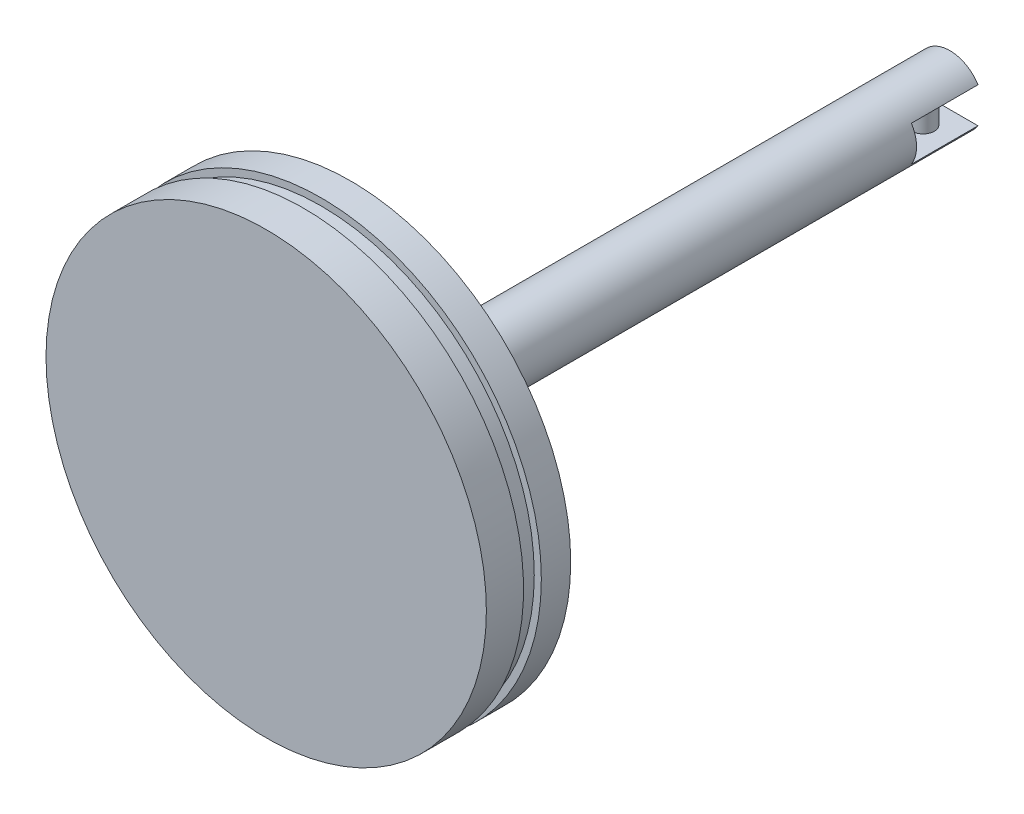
ISO-10303-21;
HEADER;
FILE_DESCRIPTION(('STEP AP214'),'2;1');
FILE_NAME('part.step','',(''),(''),'','','');
FILE_SCHEMA(('AUTOMOTIVE_DESIGN { 1 0 10303 214 1 1 1 1 }'));
ENDSEC;
DATA;
#1=APPLICATION_CONTEXT('core data for automotive mechanical design processes');
#2=APPLICATION_PROTOCOL_DEFINITION('international standard','automotive_design',2000,#1);
#3=PRODUCT_CONTEXT('',#1,'mechanical');
#4=PRODUCT('Part','Part','',(#3));
#5=PRODUCT_RELATED_PRODUCT_CATEGORY('part','',(#4));
#6=PRODUCT_DEFINITION_FORMATION('','',#4);
#7=PRODUCT_DEFINITION_CONTEXT('part definition',#1,'design');
#8=PRODUCT_DEFINITION('design','',#6,#7);
#9=PRODUCT_DEFINITION_SHAPE('','',#8);
#10=(LENGTH_UNIT() NAMED_UNIT(*) SI_UNIT(.MILLI.,.METRE.));
#11=(NAMED_UNIT(*) PLANE_ANGLE_UNIT() SI_UNIT($,.RADIAN.));
#12=(NAMED_UNIT(*) SI_UNIT($,.STERADIAN.) SOLID_ANGLE_UNIT());
#13=UNCERTAINTY_MEASURE_WITH_UNIT(LENGTH_MEASURE(1.E-05),#10,'distance_accuracy_value','');
#14=(GEOMETRIC_REPRESENTATION_CONTEXT(3) GLOBAL_UNCERTAINTY_ASSIGNED_CONTEXT((#13)) GLOBAL_UNIT_ASSIGNED_CONTEXT((#10,
#11,#12)) REPRESENTATION_CONTEXT('',''));
#15=CARTESIAN_POINT('',(0.,0.,0.));
#16=DIRECTION('',(0.,0.,1.));
#17=DIRECTION('',(1.,0.,0.));
#18=AXIS2_PLACEMENT_3D('',#15,#16,#17);
#19=CARTESIAN_POINT('',(0.,0.,-135.));
#20=DIRECTION('',(0.,0.,1.));
#21=DIRECTION('',(1.,0.,0.));
#22=AXIS2_PLACEMENT_3D('',#19,#20,#21);
#23=PLANE('',#22);
#24=CARTESIAN_POINT('',(0.,0.,-135.));
#25=DIRECTION('',(0.,0.,1.));
#26=DIRECTION('',(1.,0.,0.));
#27=AXIS2_PLACEMENT_3D('',#24,#25,#26);
#28=CIRCLE('',#27,7.5);
#29=CARTESIAN_POINT('',(-6.34428877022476,-4.,-135.));
#30=VERTEX_POINT('',#29);
#31=CARTESIAN_POINT('',(6.34428877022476,-4.,-135.));
#32=VERTEX_POINT('',#31);
#33=EDGE_CURVE('E107',#30,#32,#28,.T.);
#34=ORIENTED_EDGE('',*,*,#33,.F.);
#35=DIRECTION('',(1.,0.,0.));
#36=VECTOR('',#35,1.);
#37=CARTESIAN_POINT('',(0.,-4.,-135.));
#38=LINE('',#37,#36);
#39=EDGE_CURVE('E91',#30,#32,#38,.T.);
#40=ORIENTED_EDGE('',*,*,#39,.T.);
#41=EDGE_LOOP('',(#34,#40));
#42=FACE_BOUND('',#41,.T.);
#43=ADVANCED_FACE('F40',(#42),#23,.F.);
#44=CARTESIAN_POINT('',(0.,0.,3.));
#45=DIRECTION('',(0.,0.,-1.));
#46=DIRECTION('',(-1.,0.,0.));
#47=AXIS2_PLACEMENT_3D('',#44,#45,#46);
#48=CYLINDRICAL_SURFACE('',#47,49.6);
#49=CARTESIAN_POINT('',(0.,0.,0.));
#50=DIRECTION('',(0.,0.,1.));
#51=DIRECTION('',(1.,0.,0.));
#52=AXIS2_PLACEMENT_3D('',#49,#50,#51);
#53=CIRCLE('',#52,49.6);
#54=CARTESIAN_POINT('',(49.6,0.,0.));
#55=VERTEX_POINT('',#54);
#56=EDGE_CURVE('E155',#55,#55,#53,.T.);
#57=ORIENTED_EDGE('',*,*,#56,.T.);
#58=EDGE_LOOP('',(#57));
#59=FACE_BOUND('',#58,.T.);
#60=CARTESIAN_POINT('',(0.,0.,6.62025765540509));
#61=DIRECTION('',(0.,0.,1.));
#62=DIRECTION('',(1.,0.,0.));
#63=AXIS2_PLACEMENT_3D('',#60,#61,#62);
#64=CIRCLE('',#63,49.6);
#65=CARTESIAN_POINT('',(49.6,0.,6.62025765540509));
#66=VERTEX_POINT('',#65);
#67=EDGE_CURVE('E122',#66,#66,#64,.T.);
#68=ORIENTED_EDGE('',*,*,#67,.F.);
#69=EDGE_LOOP('',(#68));
#70=FACE_BOUND('',#69,.T.);
#71=ADVANCED_FACE('F42',(#59,#70),#48,.T.);
#72=CARTESIAN_POINT('',(0.,0.,0.));
#73=DIRECTION('',(0.,0.,1.));
#74=DIRECTION('',(1.,0.,0.));
#75=AXIS2_PLACEMENT_3D('',#72,#73,#74);
#76=PLANE('',#75);
#77=CARTESIAN_POINT('',(0.,0.,0.));
#78=DIRECTION('',(0.,0.,1.));
#79=DIRECTION('',(1.,0.,0.));
#80=AXIS2_PLACEMENT_3D('',#77,#78,#79);
#81=CIRCLE('',#80,7.5);
#82=CARTESIAN_POINT('',(7.5,0.,0.));
#83=VERTEX_POINT('',#82);
#84=EDGE_CURVE('E115',#83,#83,#81,.T.);
#85=ORIENTED_EDGE('',*,*,#84,.T.);
#86=EDGE_LOOP('',(#85));
#87=FACE_BOUND('',#86,.T.);
#88=ORIENTED_EDGE('',*,*,#56,.F.);
#89=EDGE_LOOP('',(#88));
#90=FACE_BOUND('',#89,.T.);
#91=ADVANCED_FACE('F251',(#87,#90),#76,.F.);
#92=CARTESIAN_POINT('',(0.,0.,-135.));
#93=DIRECTION('',(0.,0.,1.));
#94=DIRECTION('',(1.,0.,0.));
#95=AXIS2_PLACEMENT_3D('',#92,#93,#94);
#96=CYLINDRICAL_SURFACE('',#95,7.5);
#97=DIRECTION('',(0.,0.,1.));
#98=VECTOR('',#97,1.);
#99=CARTESIAN_POINT('',(-6.34428877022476,-4.,-135.));
#100=LINE('',#99,#98);
#101=CARTESIAN_POINT('',(-6.34428877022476,-4.,-120.));
#102=VERTEX_POINT('',#101);
#103=EDGE_CURVE('E65',#30,#102,#100,.T.);
#104=ORIENTED_EDGE('',*,*,#103,.F.);
#105=ORIENTED_EDGE('',*,*,#33,.T.);
#106=DIRECTION('',(0.,0.,1.));
#107=VECTOR('',#106,1.);
#108=CARTESIAN_POINT('',(6.34428877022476,-4.,-135.));
#109=LINE('',#108,#107);
#110=CARTESIAN_POINT('',(6.34428877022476,-4.,-120.));
#111=VERTEX_POINT('',#110);
#112=EDGE_CURVE('E211',#111,#32,#109,.F.);
#113=ORIENTED_EDGE('',*,*,#112,.F.);
#114=CARTESIAN_POINT('',(0.,0.,-120.));
#115=DIRECTION('',(0.,0.,1.));
#116=DIRECTION('',(1.,0.,0.));
#117=AXIS2_PLACEMENT_3D('',#114,#115,#116);
#118=CIRCLE('',#117,7.5);
#119=CARTESIAN_POINT('',(6.34428877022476,4.,-120.));
#120=VERTEX_POINT('',#119);
#121=EDGE_CURVE('E100',#120,#111,#118,.F.);
#122=ORIENTED_EDGE('',*,*,#121,.F.);
#123=DIRECTION('',(0.,0.,1.));
#124=VECTOR('',#123,1.);
#125=CARTESIAN_POINT('',(6.34428877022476,4.,-135.));
#126=LINE('',#125,#124);
#127=CARTESIAN_POINT('',(6.34428877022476,4.,-135.));
#128=VERTEX_POINT('',#127);
#129=EDGE_CURVE('E85',#128,#120,#126,.T.);
#130=ORIENTED_EDGE('',*,*,#129,.F.);
#131=CARTESIAN_POINT('',(-6.34428877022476,4.,-135.));
#132=VERTEX_POINT('',#131);
#133=EDGE_CURVE('E98',#128,#132,#28,.T.);
#134=ORIENTED_EDGE('',*,*,#133,.T.);
#135=DIRECTION('',(0.,0.,1.));
#136=VECTOR('',#135,1.);
#137=CARTESIAN_POINT('',(-6.34428877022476,4.,-135.));
#138=LINE('',#137,#136);
#139=CARTESIAN_POINT('',(-6.34428877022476,4.,-120.));
#140=VERTEX_POINT('',#139);
#141=EDGE_CURVE('E57',#140,#132,#138,.F.);
#142=ORIENTED_EDGE('',*,*,#141,.F.);
#143=EDGE_CURVE('E50',#102,#140,#118,.F.);
#144=ORIENTED_EDGE('',*,*,#143,.F.);
#145=EDGE_LOOP('',(#104,#105,#113,#122,#130,#134,#142,#144));
#146=FACE_BOUND('',#145,.T.);
#147=ORIENTED_EDGE('',*,*,#84,.F.);
#148=EDGE_LOOP('',(#147));
#149=FACE_BOUND('',#148,.T.);
#150=ADVANCED_FACE('F96',(#146,#149),#96,.T.);
#151=ORIENTED_EDGE('',*,*,#133,.F.);
#152=DIRECTION('',(-1.,0.,0.));
#153=VECTOR('',#152,1.);
#154=CARTESIAN_POINT('',(0.,4.,-135.));
#155=LINE('',#154,#153);
#156=EDGE_CURVE('E82',#128,#132,#155,.T.);
#157=ORIENTED_EDGE('',*,*,#156,.T.);
#158=EDGE_LOOP('',(#151,#157));
#159=FACE_BOUND('',#158,.T.);
#160=ADVANCED_FACE('F104',(#159),#23,.F.);
#161=CARTESIAN_POINT('',(0.,-50.8877083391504,6.62025765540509));
#162=DIRECTION('',(0.,0.,1.));
#163=DIRECTION('',(1.,0.,0.));
#164=AXIS2_PLACEMENT_3D('',#161,#162,#163);
#165=PLANE('',#164);
#166=CARTESIAN_POINT('',(0.,0.,6.62025765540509));
#167=DIRECTION('',(0.,0.,-1.));
#168=DIRECTION('',(-1.,0.,0.));
#169=AXIS2_PLACEMENT_3D('',#166,#167,#168);
#170=CIRCLE('',#169,48.0103822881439);
#171=CARTESIAN_POINT('',(-48.0103822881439,0.,6.62025765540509));
#172=VERTEX_POINT('',#171);
#173=EDGE_CURVE('E118',#172,#172,#170,.T.);
#174=ORIENTED_EDGE('',*,*,#173,.T.);
#175=EDGE_LOOP('',(#174));
#176=FACE_BOUND('',#175,.T.);
#177=ORIENTED_EDGE('',*,*,#67,.T.);
#178=EDGE_LOOP('',(#177));
#179=FACE_BOUND('',#178,.T.);
#180=ADVANCED_FACE('F225',(#176,#179),#165,.T.);
#181=CARTESIAN_POINT('',(0.,-50.8877083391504,10.6202576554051));
#182=DIRECTION('',(0.,0.,-1.));
#183=DIRECTION('',(-1.,0.,0.));
#184=AXIS2_PLACEMENT_3D('',#181,#182,#183);
#185=PLANE('',#184);
#186=CARTESIAN_POINT('',(0.,0.,10.6202576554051));
#187=DIRECTION('',(0.,0.,-1.));
#188=DIRECTION('',(-1.,0.,0.));
#189=AXIS2_PLACEMENT_3D('',#186,#187,#188);
#190=CIRCLE('',#189,48.0103822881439);
#191=CARTESIAN_POINT('',(-48.0103822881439,0.,10.6202576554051));
#192=VERTEX_POINT('',#191);
#193=EDGE_CURVE('E216',#192,#192,#190,.T.);
#194=ORIENTED_EDGE('',*,*,#193,.F.);
#195=EDGE_LOOP('',(#194));
#196=FACE_BOUND('',#195,.T.);
#197=CARTESIAN_POINT('',(0.,0.,10.6202576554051));
#198=DIRECTION('',(0.,0.,-1.));
#199=DIRECTION('',(-1.,0.,0.));
#200=AXIS2_PLACEMENT_3D('',#197,#198,#199);
#201=CIRCLE('',#200,49.6);
#202=CARTESIAN_POINT('',(-49.6,0.,10.6202576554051));
#203=VERTEX_POINT('',#202);
#204=EDGE_CURVE('E190',#203,#203,#201,.T.);
#205=ORIENTED_EDGE('',*,*,#204,.T.);
#206=EDGE_LOOP('',(#205));
#207=FACE_BOUND('',#206,.T.);
#208=ADVANCED_FACE('F231',(#196,#207),#185,.T.);
#209=CARTESIAN_POINT('',(0.,0.,0.));
#210=DIRECTION('',(0.,0.,-1.));
#211=DIRECTION('',(-1.,0.,0.));
#212=AXIS2_PLACEMENT_3D('',#209,#210,#211);
#213=CYLINDRICAL_SURFACE('',#212,48.0103822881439);
#214=ORIENTED_EDGE('',*,*,#193,.T.);
#215=EDGE_LOOP('',(#214));
#216=FACE_BOUND('',#215,.T.);
#217=ORIENTED_EDGE('',*,*,#173,.F.);
#218=EDGE_LOOP('',(#217));
#219=FACE_BOUND('',#218,.T.);
#220=ADVANCED_FACE('F228',(#216,#219),#213,.T.);
#221=CARTESIAN_POINT('',(0.,0.,19.));
#222=DIRECTION('',(0.,0.,1.));
#223=DIRECTION('',(1.,0.,0.));
#224=AXIS2_PLACEMENT_3D('',#221,#222,#223);
#225=PLANE('',#224);
#226=CARTESIAN_POINT('',(0.,0.,19.));
#227=DIRECTION('',(0.,0.,1.));
#228=DIRECTION('',(1.,0.,0.));
#229=AXIS2_PLACEMENT_3D('',#226,#227,#228);
#230=CIRCLE('',#229,49.6);
#231=CARTESIAN_POINT('',(49.6,0.,19.));
#232=VERTEX_POINT('',#231);
#233=EDGE_CURVE('E147',#232,#232,#230,.T.);
#234=ORIENTED_EDGE('',*,*,#233,.T.);
#235=EDGE_LOOP('',(#234));
#236=FACE_BOUND('',#235,.T.);
#237=ADVANCED_FACE('F230',(#236),#225,.T.);
#238=ORIENTED_EDGE('',*,*,#233,.F.);
#239=EDGE_LOOP('',(#238));
#240=FACE_BOUND('',#239,.T.);
#241=ORIENTED_EDGE('',*,*,#204,.F.);
#242=EDGE_LOOP('',(#241));
#243=FACE_BOUND('',#242,.T.);
#244=ADVANCED_FACE('F237',(#240,#243),#48,.T.);
#245=CARTESIAN_POINT('',(-10.6083117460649,-4.,-120.));
#246=DIRECTION('',(0.,-1.,0.));
#247=DIRECTION('',(1.,0.,0.));
#248=AXIS2_PLACEMENT_3D('',#245,#246,#247);
#249=PLANE('',#248);
#250=CARTESIAN_POINT('',(0.,-4.,-129.));
#251=DIRECTION('',(0.,-1.,0.));
#252=DIRECTION('',(1.,0.,0.));
#253=AXIS2_PLACEMENT_3D('',#250,#251,#252);
#254=CIRCLE('',#253,2.5);
#255=CARTESIAN_POINT('',(2.5,-4.,-129.));
#256=VERTEX_POINT('',#255);
#257=EDGE_CURVE('E11',#256,#256,#254,.F.);
#258=ORIENTED_EDGE('',*,*,#257,.F.);
#259=EDGE_LOOP('',(#258));
#260=FACE_BOUND('',#259,.T.);
#261=ORIENTED_EDGE('',*,*,#112,.T.);
#262=ORIENTED_EDGE('',*,*,#39,.F.);
#263=ORIENTED_EDGE('',*,*,#103,.T.);
#264=DIRECTION('',(-1.,0.,0.));
#265=VECTOR('',#264,1.);
#266=CARTESIAN_POINT('',(-10.6083117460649,-4.,-120.));
#267=LINE('',#266,#265);
#268=EDGE_CURVE('E102',#111,#102,#267,.T.);
#269=ORIENTED_EDGE('',*,*,#268,.F.);
#270=EDGE_LOOP('',(#261,#262,#263,#269));
#271=FACE_BOUND('',#270,.T.);
#272=ADVANCED_FACE('F394',(#260,#271),#249,.F.);
#273=CARTESIAN_POINT('',(-10.6083117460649,4.,-120.));
#274=DIRECTION('',(0.,1.,0.));
#275=DIRECTION('',(-1.,0.,0.));
#276=AXIS2_PLACEMENT_3D('',#273,#274,#275);
#277=PLANE('',#276);
#278=ORIENTED_EDGE('',*,*,#141,.T.);
#279=ORIENTED_EDGE('',*,*,#156,.F.);
#280=ORIENTED_EDGE('',*,*,#129,.T.);
#281=DIRECTION('',(1.,0.,0.));
#282=VECTOR('',#281,1.);
#283=CARTESIAN_POINT('',(-10.6083117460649,4.,-120.));
#284=LINE('',#283,#282);
#285=EDGE_CURVE('E204',#140,#120,#284,.T.);
#286=ORIENTED_EDGE('',*,*,#285,.F.);
#287=EDGE_LOOP('',(#278,#279,#280,#286));
#288=FACE_BOUND('',#287,.T.);
#289=ADVANCED_FACE('F84',(#288),#277,.F.);
#290=CARTESIAN_POINT('',(0.,0.,-120.));
#291=DIRECTION('',(0.,0.,1.));
#292=DIRECTION('',(1.,0.,0.));
#293=AXIS2_PLACEMENT_3D('',#290,#291,#292);
#294=PLANE('',#293);
#295=ORIENTED_EDGE('',*,*,#143,.T.);
#296=ORIENTED_EDGE('',*,*,#285,.T.);
#297=ORIENTED_EDGE('',*,*,#121,.T.);
#298=ORIENTED_EDGE('',*,*,#268,.T.);
#299=EDGE_LOOP('',(#295,#296,#297,#298));
#300=FACE_BOUND('',#299,.T.);
#301=ADVANCED_FACE('F203',(#300),#294,.F.);
#302=CARTESIAN_POINT('',(0.,3.,-129.));
#303=DIRECTION('',(0.,-1.,0.));
#304=DIRECTION('',(1.,0.,0.));
#305=AXIS2_PLACEMENT_3D('',#302,#303,#304);
#306=CYLINDRICAL_SURFACE('',#305,2.5);
#307=CARTESIAN_POINT('',(0.,3.,-129.));
#308=DIRECTION('',(0.,1.,0.));
#309=DIRECTION('',(-1.,0.,0.));
#310=AXIS2_PLACEMENT_3D('',#307,#308,#309);
#311=CIRCLE('',#310,2.5);
#312=CARTESIAN_POINT('',(-2.5,3.,-129.));
#313=VERTEX_POINT('',#312);
#314=EDGE_CURVE('E206',#313,#313,#311,.T.);
#315=ORIENTED_EDGE('',*,*,#314,.F.);
#316=EDGE_LOOP('',(#315));
#317=FACE_BOUND('',#316,.T.);
#318=ORIENTED_EDGE('',*,*,#257,.T.);
#319=EDGE_LOOP('',(#318));
#320=FACE_BOUND('',#319,.T.);
#321=ADVANCED_FACE('F410',(#317,#320),#306,.T.);
#322=CARTESIAN_POINT('',(0.,3.,-129.));
#323=DIRECTION('',(0.,1.,0.));
#324=DIRECTION('',(-1.,0.,0.));
#325=AXIS2_PLACEMENT_3D('',#322,#323,#324);
#326=PLANE('',#325);
#327=ORIENTED_EDGE('',*,*,#314,.T.);
#328=EDGE_LOOP('',(#327));
#329=FACE_BOUND('',#328,.T.);
#330=ADVANCED_FACE('F416',(#329),#326,.T.);
#331=CLOSED_SHELL('',(#43,#71,#91,#150,#160,#180,#208,#220,#237,#244,#272,#289,#301,#321,#330));
#332=CARTESIAN_POINT('',(0.,0.,3.));
#333=DIRECTION('',(0.,0.,1.));
#334=DIRECTION('',(1.,0.,0.));
#335=AXIS2_PLACEMENT_3D('',#332,#333,#334);
#336=PLANE('',#335);
#337=CARTESIAN_POINT('',(0.,0.,3.));
#338=DIRECTION('',(0.,0.,1.));
#339=DIRECTION('',(1.,0.,0.));
#340=AXIS2_PLACEMENT_3D('',#337,#338,#339);
#341=CIRCLE('',#340,5.);
#342=CARTESIAN_POINT('',(5.,0.,3.));
#343=VERTEX_POINT('',#342);
#344=EDGE_CURVE('E106',#343,#343,#341,.T.);
#345=ORIENTED_EDGE('',*,*,#344,.F.);
#346=EDGE_LOOP('',(#345));
#347=FACE_BOUND('',#346,.T.);
#348=CARTESIAN_POINT('',(-12.5553753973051,26.3329781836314,3.));
#349=DIRECTION('',(0.,0.,1.));
#350=DIRECTION('',(1.,0.,0.));
#351=AXIS2_PLACEMENT_3D('',#348,#349,#350);
#352=CIRCLE('',#351,2.5);
#353=CARTESIAN_POINT('',(-10.0553753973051,26.3329781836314,3.));
#354=VERTEX_POINT('',#353);
#355=EDGE_CURVE('E112',#354,#354,#352,.T.);
#356=ORIENTED_EDGE('',*,*,#355,.F.);
#357=EDGE_LOOP('',(#356));
#358=FACE_BOUND('',#357,.T.);
#359=CARTESIAN_POINT('',(17.4025494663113,21.919229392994,3.));
#360=DIRECTION('',(0.,0.,1.));
#361=DIRECTION('',(1.,0.,0.));
#362=AXIS2_PLACEMENT_3D('',#359,#360,#361);
#363=CIRCLE('',#362,2.5);
#364=CARTESIAN_POINT('',(19.9025494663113,21.919229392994,3.));
#365=VERTEX_POINT('',#364);
#366=EDGE_CURVE('E127',#365,#365,#363,.T.);
#367=ORIENTED_EDGE('',*,*,#366,.F.);
#368=EDGE_LOOP('',(#367));
#369=FACE_BOUND('',#368,.T.);
#370=CARTESIAN_POINT('',(29.0283101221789,-5.22974658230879,3.));
#371=DIRECTION('',(0.,0.,1.));
#372=DIRECTION('',(1.,0.,0.));
#373=AXIS2_PLACEMENT_3D('',#370,#371,#372);
#374=CIRCLE('',#373,2.5);
#375=CARTESIAN_POINT('',(31.5283101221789,-5.22974658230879,3.));
#376=VERTEX_POINT('',#375);
#377=EDGE_CURVE('E131',#376,#376,#374,.T.);
#378=ORIENTED_EDGE('',*,*,#377,.F.);
#379=EDGE_LOOP('',(#378));
#380=FACE_BOUND('',#379,.T.);
#381=CARTESIAN_POINT('',(10.7973914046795,-30.7469047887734,3.));
#382=DIRECTION('',(0.,0.,1.));
#383=DIRECTION('',(1.,0.,0.));
#384=AXIS2_PLACEMENT_3D('',#381,#382,#383);
#385=CIRCLE('',#384,2.5);
#386=CARTESIAN_POINT('',(13.2973914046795,-30.7469047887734,3.));
#387=VERTEX_POINT('',#386);
#388=EDGE_CURVE('E135',#387,#387,#385,.T.);
#389=ORIENTED_EDGE('',*,*,#388,.F.);
#390=EDGE_LOOP('',(#389));
#391=FACE_BOUND('',#390,.T.);
#392=CARTESIAN_POINT('',(-20.9711520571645,-26.3717704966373,3.));
#393=DIRECTION('',(0.,0.,1.));
#394=DIRECTION('',(1.,0.,0.));
#395=AXIS2_PLACEMENT_3D('',#392,#393,#394);
#396=CIRCLE('',#395,2.5);
#397=CARTESIAN_POINT('',(-18.4711520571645,-26.3717704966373,3.));
#398=VERTEX_POINT('',#397);
#399=EDGE_CURVE('E139',#398,#398,#396,.T.);
#400=ORIENTED_EDGE('',*,*,#399,.F.);
#401=EDGE_LOOP('',(#400));
#402=FACE_BOUND('',#401,.T.);
#403=CARTESIAN_POINT('',(-35.9876396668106,-3.67966705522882,3.));
#404=DIRECTION('',(0.,0.,1.));
#405=DIRECTION('',(1.,0.,0.));
#406=AXIS2_PLACEMENT_3D('',#403,#404,#405);
#407=CIRCLE('',#406,2.5);
#408=CARTESIAN_POINT('',(-33.4876396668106,-3.67966705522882,3.));
#409=VERTEX_POINT('',#408);
#410=EDGE_CURVE('E143',#409,#409,#407,.T.);
#411=ORIENTED_EDGE('',*,*,#410,.F.);
#412=EDGE_LOOP('',(#411));
#413=FACE_BOUND('',#412,.T.);
#414=CARTESIAN_POINT('',(0.,0.,3.));
#415=DIRECTION('',(0.,0.,1.));
#416=DIRECTION('',(1.,0.,0.));
#417=AXIS2_PLACEMENT_3D('',#414,#415,#416);
#418=CIRCLE('',#417,46.);
#419=CARTESIAN_POINT('',(46.,0.,3.));
#420=VERTEX_POINT('',#419);
#421=EDGE_CURVE('E156',#420,#420,#418,.F.);
#422=ORIENTED_EDGE('',*,*,#421,.F.);
#423=EDGE_LOOP('',(#422));
#424=FACE_BOUND('',#423,.T.);
#425=ADVANCED_FACE('F301',(#347,#358,#369,#380,#391,#402,#413,#424),#336,.T.);
#426=CARTESIAN_POINT('',(0.,0.,15.));
#427=DIRECTION('',(0.,0.,-1.));
#428=DIRECTION('',(-1.,0.,0.));
#429=AXIS2_PLACEMENT_3D('',#426,#427,#428);
#430=CYLINDRICAL_SURFACE('',#429,46.);
#431=ORIENTED_EDGE('',*,*,#421,.T.);
#432=EDGE_LOOP('',(#431));
#433=FACE_BOUND('',#432,.T.);
#434=CARTESIAN_POINT('',(0.,0.,15.));
#435=DIRECTION('',(0.,0.,1.));
#436=DIRECTION('',(1.,0.,0.));
#437=AXIS2_PLACEMENT_3D('',#434,#435,#436);
#438=CIRCLE('',#437,46.);
#439=CARTESIAN_POINT('',(46.,0.,15.));
#440=VERTEX_POINT('',#439);
#441=EDGE_CURVE('E151',#440,#440,#438,.T.);
#442=ORIENTED_EDGE('',*,*,#441,.T.);
#443=EDGE_LOOP('',(#442));
#444=FACE_BOUND('',#443,.T.);
#445=ADVANCED_FACE('F297',(#433,#444),#430,.F.);
#446=CARTESIAN_POINT('',(0.,0.,15.));
#447=DIRECTION('',(0.,0.,1.));
#448=DIRECTION('',(1.,0.,0.));
#449=AXIS2_PLACEMENT_3D('',#446,#447,#448);
#450=PLANE('',#449);
#451=CARTESIAN_POINT('',(0.,0.,15.));
#452=DIRECTION('',(0.,0.,1.));
#453=DIRECTION('',(1.,0.,0.));
#454=AXIS2_PLACEMENT_3D('',#451,#452,#453);
#455=CIRCLE('',#454,5.);
#456=CARTESIAN_POINT('',(5.,0.,15.));
#457=VERTEX_POINT('',#456);
#458=EDGE_CURVE('E92',#457,#457,#455,.F.);
#459=ORIENTED_EDGE('',*,*,#458,.F.);
#460=EDGE_LOOP('',(#459));
#461=FACE_BOUND('',#460,.T.);
#462=CARTESIAN_POINT('',(-12.5553753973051,26.3329781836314,15.));
#463=DIRECTION('',(0.,0.,1.));
#464=DIRECTION('',(1.,0.,0.));
#465=AXIS2_PLACEMENT_3D('',#462,#463,#464);
#466=CIRCLE('',#465,2.5);
#467=CARTESIAN_POINT('',(-10.0553753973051,26.3329781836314,15.));
#468=VERTEX_POINT('',#467);
#469=EDGE_CURVE('E183',#468,#468,#466,.F.);
#470=ORIENTED_EDGE('',*,*,#469,.F.);
#471=EDGE_LOOP('',(#470));
#472=FACE_BOUND('',#471,.T.);
#473=CARTESIAN_POINT('',(17.4025494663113,21.919229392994,15.));
#474=DIRECTION('',(0.,0.,1.));
#475=DIRECTION('',(1.,0.,0.));
#476=AXIS2_PLACEMENT_3D('',#473,#474,#475);
#477=CIRCLE('',#476,2.5);
#478=CARTESIAN_POINT('',(19.9025494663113,21.919229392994,15.));
#479=VERTEX_POINT('',#478);
#480=EDGE_CURVE('E179',#479,#479,#477,.F.);
#481=ORIENTED_EDGE('',*,*,#480,.F.);
#482=EDGE_LOOP('',(#481));
#483=FACE_BOUND('',#482,.T.);
#484=CARTESIAN_POINT('',(29.0283101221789,-5.22974658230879,15.));
#485=DIRECTION('',(0.,0.,1.));
#486=DIRECTION('',(1.,0.,0.));
#487=AXIS2_PLACEMENT_3D('',#484,#485,#486);
#488=CIRCLE('',#487,2.5);
#489=CARTESIAN_POINT('',(31.5283101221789,-5.22974658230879,15.));
#490=VERTEX_POINT('',#489);
#491=EDGE_CURVE('E175',#490,#490,#488,.F.);
#492=ORIENTED_EDGE('',*,*,#491,.F.);
#493=EDGE_LOOP('',(#492));
#494=FACE_BOUND('',#493,.T.);
#495=CARTESIAN_POINT('',(10.7973914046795,-30.7469047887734,15.));
#496=DIRECTION('',(0.,0.,1.));
#497=DIRECTION('',(1.,0.,0.));
#498=AXIS2_PLACEMENT_3D('',#495,#496,#497);
#499=CIRCLE('',#498,2.5);
#500=CARTESIAN_POINT('',(13.2973914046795,-30.7469047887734,15.));
#501=VERTEX_POINT('',#500);
#502=EDGE_CURVE('E171',#501,#501,#499,.F.);
#503=ORIENTED_EDGE('',*,*,#502,.F.);
#504=EDGE_LOOP('',(#503));
#505=FACE_BOUND('',#504,.T.);
#506=CARTESIAN_POINT('',(-20.9711520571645,-26.3717704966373,15.));
#507=DIRECTION('',(0.,0.,1.));
#508=DIRECTION('',(1.,0.,0.));
#509=AXIS2_PLACEMENT_3D('',#506,#507,#508);
#510=CIRCLE('',#509,2.5);
#511=CARTESIAN_POINT('',(-18.4711520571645,-26.3717704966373,15.));
#512=VERTEX_POINT('',#511);
#513=EDGE_CURVE('E167',#512,#512,#510,.F.);
#514=ORIENTED_EDGE('',*,*,#513,.F.);
#515=EDGE_LOOP('',(#514));
#516=FACE_BOUND('',#515,.T.);
#517=CARTESIAN_POINT('',(-35.9876396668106,-3.67966705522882,15.));
#518=DIRECTION('',(0.,0.,1.));
#519=DIRECTION('',(1.,0.,0.));
#520=AXIS2_PLACEMENT_3D('',#517,#518,#519);
#521=CIRCLE('',#520,2.5);
#522=CARTESIAN_POINT('',(-33.4876396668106,-3.67966705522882,15.));
#523=VERTEX_POINT('',#522);
#524=EDGE_CURVE('E160',#523,#523,#521,.F.);
#525=ORIENTED_EDGE('',*,*,#524,.F.);
#526=EDGE_LOOP('',(#525));
#527=FACE_BOUND('',#526,.T.);
#528=ORIENTED_EDGE('',*,*,#441,.F.);
#529=EDGE_LOOP('',(#528));
#530=FACE_BOUND('',#529,.T.);
#531=ADVANCED_FACE('F292',(#461,#472,#483,#494,#505,#516,#527,#530),#450,.F.);
#532=CARTESIAN_POINT('',(-35.9876396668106,-3.67966705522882,19.));
#533=DIRECTION('',(0.,0.,-1.));
#534=DIRECTION('',(-1.,0.,0.));
#535=AXIS2_PLACEMENT_3D('',#532,#533,#534);
#536=CYLINDRICAL_SURFACE('',#535,2.5);
#537=ORIENTED_EDGE('',*,*,#410,.T.);
#538=EDGE_LOOP('',(#537));
#539=FACE_BOUND('',#538,.T.);
#540=ORIENTED_EDGE('',*,*,#524,.T.);
#541=EDGE_LOOP('',(#540));
#542=FACE_BOUND('',#541,.T.);
#543=ADVANCED_FACE('F289',(#539,#542),#536,.T.);
#544=CARTESIAN_POINT('',(-20.9711520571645,-26.3717704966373,19.));
#545=DIRECTION('',(0.,0.,-1.));
#546=DIRECTION('',(-1.,0.,0.));
#547=AXIS2_PLACEMENT_3D('',#544,#545,#546);
#548=CYLINDRICAL_SURFACE('',#547,2.5);
#549=ORIENTED_EDGE('',*,*,#399,.T.);
#550=EDGE_LOOP('',(#549));
#551=FACE_BOUND('',#550,.T.);
#552=ORIENTED_EDGE('',*,*,#513,.T.);
#553=EDGE_LOOP('',(#552));
#554=FACE_BOUND('',#553,.T.);
#555=ADVANCED_FACE('F285',(#551,#554),#548,.T.);
#556=CARTESIAN_POINT('',(10.7973914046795,-30.7469047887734,19.));
#557=DIRECTION('',(0.,0.,-1.));
#558=DIRECTION('',(-1.,0.,0.));
#559=AXIS2_PLACEMENT_3D('',#556,#557,#558);
#560=CYLINDRICAL_SURFACE('',#559,2.5);
#561=ORIENTED_EDGE('',*,*,#388,.T.);
#562=EDGE_LOOP('',(#561));
#563=FACE_BOUND('',#562,.T.);
#564=ORIENTED_EDGE('',*,*,#502,.T.);
#565=EDGE_LOOP('',(#564));
#566=FACE_BOUND('',#565,.T.);
#567=ADVANCED_FACE('F281',(#563,#566),#560,.T.);
#568=CARTESIAN_POINT('',(29.0283101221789,-5.22974658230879,19.));
#569=DIRECTION('',(0.,0.,-1.));
#570=DIRECTION('',(-1.,0.,0.));
#571=AXIS2_PLACEMENT_3D('',#568,#569,#570);
#572=CYLINDRICAL_SURFACE('',#571,2.5);
#573=ORIENTED_EDGE('',*,*,#377,.T.);
#574=EDGE_LOOP('',(#573));
#575=FACE_BOUND('',#574,.T.);
#576=ORIENTED_EDGE('',*,*,#491,.T.);
#577=EDGE_LOOP('',(#576));
#578=FACE_BOUND('',#577,.T.);
#579=ADVANCED_FACE('F277',(#575,#578),#572,.T.);
#580=CARTESIAN_POINT('',(17.4025494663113,21.919229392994,19.));
#581=DIRECTION('',(0.,0.,-1.));
#582=DIRECTION('',(-1.,0.,0.));
#583=AXIS2_PLACEMENT_3D('',#580,#581,#582);
#584=CYLINDRICAL_SURFACE('',#583,2.5);
#585=ORIENTED_EDGE('',*,*,#366,.T.);
#586=EDGE_LOOP('',(#585));
#587=FACE_BOUND('',#586,.T.);
#588=ORIENTED_EDGE('',*,*,#480,.T.);
#589=EDGE_LOOP('',(#588));
#590=FACE_BOUND('',#589,.T.);
#591=ADVANCED_FACE('F273',(#587,#590),#584,.T.);
#592=CARTESIAN_POINT('',(-12.5553753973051,26.3329781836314,19.));
#593=DIRECTION('',(0.,0.,-1.));
#594=DIRECTION('',(-1.,0.,0.));
#595=AXIS2_PLACEMENT_3D('',#592,#593,#594);
#596=CYLINDRICAL_SURFACE('',#595,2.5);
#597=ORIENTED_EDGE('',*,*,#355,.T.);
#598=EDGE_LOOP('',(#597));
#599=FACE_BOUND('',#598,.T.);
#600=ORIENTED_EDGE('',*,*,#469,.T.);
#601=EDGE_LOOP('',(#600));
#602=FACE_BOUND('',#601,.T.);
#603=ADVANCED_FACE('F268',(#599,#602),#596,.T.);
#604=CARTESIAN_POINT('',(0.,0.,19.));
#605=DIRECTION('',(0.,0.,-1.));
#606=DIRECTION('',(-1.,0.,0.));
#607=AXIS2_PLACEMENT_3D('',#604,#605,#606);
#608=CYLINDRICAL_SURFACE('',#607,5.);
#609=ORIENTED_EDGE('',*,*,#344,.T.);
#610=EDGE_LOOP('',(#609));
#611=FACE_BOUND('',#610,.T.);
#612=ORIENTED_EDGE('',*,*,#458,.T.);
#613=EDGE_LOOP('',(#612));
#614=FACE_BOUND('',#613,.T.);
#615=ADVANCED_FACE('F265',(#611,#614),#608,.T.);
#616=CLOSED_SHELL('',(#425,#445,#531,#543,#555,#567,#579,#591,#603,#615));
#617=ORIENTED_CLOSED_SHELL('',*,#616,.T.);
#618=BREP_WITH_VOIDS('B2',#331,(#617));
#619=ADVANCED_BREP_SHAPE_REPRESENTATION('',(#18,#618),#14);
#620=SHAPE_DEFINITION_REPRESENTATION(#9,#619);
ENDSEC;
END-ISO-10303-21;
